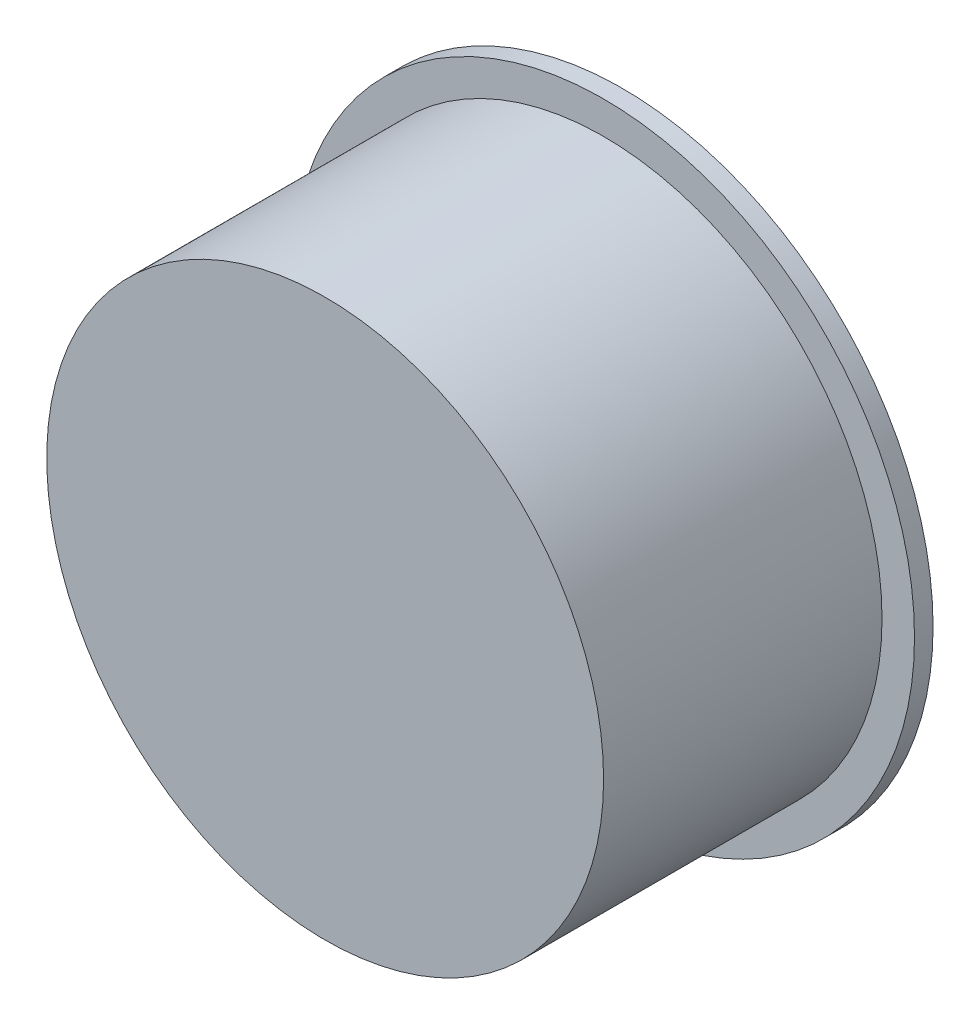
from build123d import *

# Parameters (mm, degrees)
CROQUIS1_R              = 33.5
SALIENTE_EXTRUIR1_DEPTH = 2
CROQUIS2_R              = 30
SALIENTE_EXTRUIR2_DEPTH = 30
CROQUIS3_R              = 27.5
CORTAR_EXTRUIR1_DEPTH   = 30
CORTAR_EXTRUIR2_DEPTH   = 4
SALIENTE_EXTRUIR3_START = -2
CROQUIS5_R              = 30
SALIENTE_EXTRUIR3_DEPTH = 2
CROQUIS6_R              = 7.5
SALIENTE_EXTRUIR4_DEPTH = 16


with BuildPart() as part:
    # Croquis1 → Saliente-Extruir1 (new body)
    with BuildSketch(Plane.XY):
        Circle(CROQUIS1_R)
    extrude(amount=SALIENTE_EXTRUIR1_DEPTH)

    # Croquis2 → Saliente-Extruir2 (add)
    with BuildSketch(Plane.XY.offset(2)):
        Circle(CROQUIS2_R)
    extrude(amount=SALIENTE_EXTRUIR2_DEPTH)

    # Croquis3 → Cortar-Extruir1 (cut)
    with BuildSketch(Plane.XY.offset(32)):
        Circle(CROQUIS3_R)
    extrude(amount=-CORTAR_EXTRUIR1_DEPTH, mode=Mode.SUBTRACT)

    # Croquis4 → Cortar-Extruir2 (cut)
    with BuildSketch(Plane(origin=(0, 0, 0), x_dir=(-1, 0, 0), z_dir=(0, 0, -1))):
        with BuildLine():
            Line((-5.45076599, -7.149706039), (-5.45076599, 7.149706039))
            ThreePointArc((-5.45076599, 7.149706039), (0, 12.600472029), (5.45076599, 7.149706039))
            Line((5.45076599, 7.149706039), (5.45076599, -7.149706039))
            ThreePointArc((5.45076599, -7.149706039), (0, -12.600472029), (-5.45076599, -7.149706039))
        make_face()
    extrude(amount=-CORTAR_EXTRUIR2_DEPTH, mode=Mode.SUBTRACT)

    # Croquis5 → Saliente-Extruir3 (add)
    with BuildSketch(Plane.XY.offset(32).offset(SALIENTE_EXTRUIR3_START)):
        Circle(CROQUIS5_R)
    extrude(amount=SALIENTE_EXTRUIR3_DEPTH)

    # Croquis6 → Saliente-Extruir4 (add)
    with BuildSketch(Plane(origin=(0, 0, 30), x_dir=(-1, 0, 0), z_dir=(0, 0, -1))):
        with Locations(Location((0, 0, 0), (0, 0, 180))):
            Circle(CROQUIS6_R)
    extrude(amount=SALIENTE_EXTRUIR4_DEPTH)


solid = part.part
